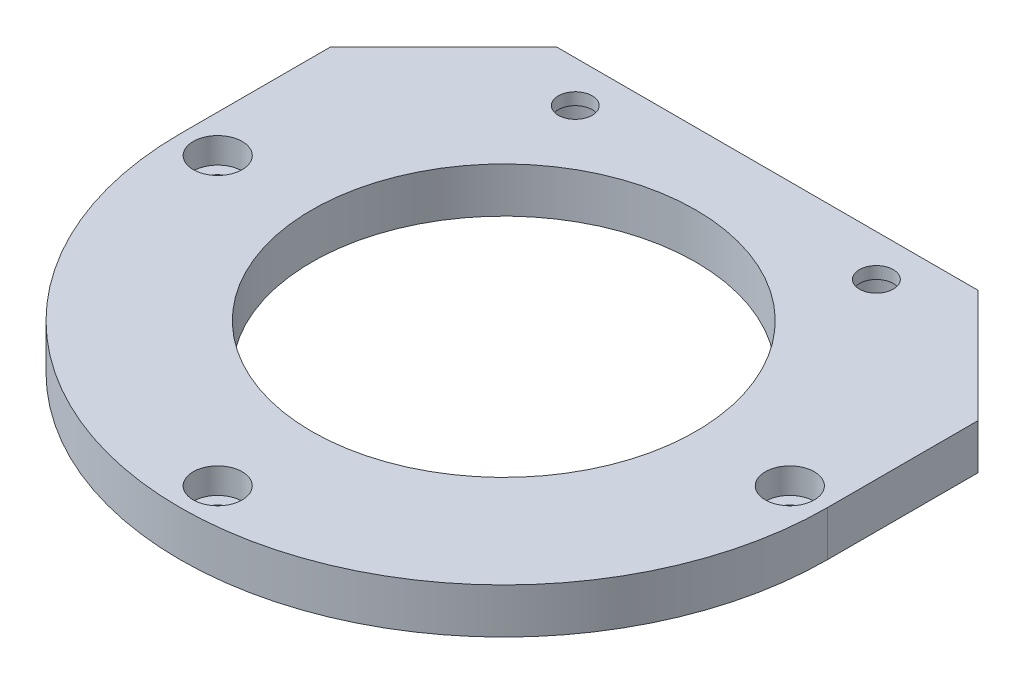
ISO-10303-21;
HEADER;
FILE_DESCRIPTION(('STEP AP214'),'2;1');
FILE_NAME('part.step','',(''),(''),'','','');
FILE_SCHEMA(('AUTOMOTIVE_DESIGN { 1 0 10303 214 1 1 1 1 }'));
ENDSEC;
DATA;
#1=APPLICATION_CONTEXT('core data for automotive mechanical design processes');
#2=APPLICATION_PROTOCOL_DEFINITION('international standard','automotive_design',2000,#1);
#3=PRODUCT_CONTEXT('',#1,'mechanical');
#4=PRODUCT('Part','Part','',(#3));
#5=PRODUCT_RELATED_PRODUCT_CATEGORY('part','',(#4));
#6=PRODUCT_DEFINITION_FORMATION('','',#4);
#7=PRODUCT_DEFINITION_CONTEXT('part definition',#1,'design');
#8=PRODUCT_DEFINITION('design','',#6,#7);
#9=PRODUCT_DEFINITION_SHAPE('','',#8);
#10=(LENGTH_UNIT() NAMED_UNIT(*) SI_UNIT(.MILLI.,.METRE.));
#11=(NAMED_UNIT(*) PLANE_ANGLE_UNIT() SI_UNIT($,.RADIAN.));
#12=(NAMED_UNIT(*) SI_UNIT($,.STERADIAN.) SOLID_ANGLE_UNIT());
#13=UNCERTAINTY_MEASURE_WITH_UNIT(LENGTH_MEASURE(1.E-05),#10,'distance_accuracy_value','');
#14=(GEOMETRIC_REPRESENTATION_CONTEXT(3) GLOBAL_UNCERTAINTY_ASSIGNED_CONTEXT((#13)) GLOBAL_UNIT_ASSIGNED_CONTEXT((#10,
#11,#12)) REPRESENTATION_CONTEXT('',''));
#15=CARTESIAN_POINT('',(0.,0.,0.));
#16=DIRECTION('',(0.,0.,1.));
#17=DIRECTION('',(1.,0.,0.));
#18=AXIS2_PLACEMENT_3D('',#15,#16,#17);
#19=CARTESIAN_POINT('',(0.,6.,0.));
#20=DIRECTION('',(0.,-1.,0.));
#21=DIRECTION('',(0.,0.,-1.));
#22=AXIS2_PLACEMENT_3D('',#19,#20,#21);
#23=CYLINDRICAL_SURFACE('',#22,43.);
#24=DIRECTION('',(0.,-1.,0.));
#25=VECTOR('',#24,1.);
#26=CARTESIAN_POINT('',(43.,6.,0.));
#27=LINE('',#26,#25);
#28=CARTESIAN_POINT('',(43.,6.,0.));
#29=VERTEX_POINT('',#28);
#30=CARTESIAN_POINT('',(43.,0.,0.));
#31=VERTEX_POINT('',#30);
#32=EDGE_CURVE('E126',#29,#31,#27,.T.);
#33=ORIENTED_EDGE('',*,*,#32,.F.);
#34=CARTESIAN_POINT('',(0.,6.,0.));
#35=DIRECTION('',(0.,1.,0.));
#36=DIRECTION('',(0.,0.,1.));
#37=AXIS2_PLACEMENT_3D('',#34,#35,#36);
#38=CIRCLE('',#37,43.);
#39=CARTESIAN_POINT('',(-43.,6.,0.));
#40=VERTEX_POINT('',#39);
#41=EDGE_CURVE('E42',#40,#29,#38,.T.);
#42=ORIENTED_EDGE('',*,*,#41,.F.);
#43=DIRECTION('',(0.,-1.,0.));
#44=VECTOR('',#43,1.);
#45=CARTESIAN_POINT('',(-43.,6.,0.));
#46=LINE('',#45,#44);
#47=CARTESIAN_POINT('',(-43.,0.,0.));
#48=VERTEX_POINT('',#47);
#49=EDGE_CURVE('E129',#48,#40,#46,.F.);
#50=ORIENTED_EDGE('',*,*,#49,.F.);
#51=CARTESIAN_POINT('',(0.,0.,0.));
#52=DIRECTION('',(0.,1.,0.));
#53=DIRECTION('',(0.,0.,1.));
#54=AXIS2_PLACEMENT_3D('',#51,#52,#53);
#55=CIRCLE('',#54,43.);
#56=EDGE_CURVE('E11',#31,#48,#55,.F.);
#57=ORIENTED_EDGE('',*,*,#56,.F.);
#58=EDGE_LOOP('',(#33,#42,#50,#57));
#59=FACE_BOUND('',#58,.T.);
#60=ADVANCED_FACE('F35',(#59),#23,.T.);
#61=CARTESIAN_POINT('',(43.,6.,-35.));
#62=DIRECTION('',(-1.,0.,0.));
#63=DIRECTION('',(0.,0.,1.));
#64=AXIS2_PLACEMENT_3D('',#61,#62,#63);
#65=PLANE('',#64);
#66=DIRECTION('',(0.,0.,-1.));
#67=VECTOR('',#66,1.);
#68=CARTESIAN_POINT('',(43.,6.,-35.));
#69=LINE('',#68,#67);
#70=CARTESIAN_POINT('',(43.,6.,-19.9999999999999));
#71=VERTEX_POINT('',#70);
#72=EDGE_CURVE('E105',#29,#71,#69,.T.);
#73=ORIENTED_EDGE('',*,*,#72,.F.);
#74=ORIENTED_EDGE('',*,*,#32,.T.);
#75=DIRECTION('',(0.,0.,-1.));
#76=VECTOR('',#75,1.);
#77=CARTESIAN_POINT('',(43.,0.,-35.));
#78=LINE('',#77,#76);
#79=CARTESIAN_POINT('',(43.,0.,-19.9999999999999));
#80=VERTEX_POINT('',#79);
#81=EDGE_CURVE('E110',#31,#80,#78,.T.);
#82=ORIENTED_EDGE('',*,*,#81,.T.);
#83=DIRECTION('',(0.,1.,0.));
#84=VECTOR('',#83,1.);
#85=CARTESIAN_POINT('',(43.,6.,-19.9999999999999));
#86=LINE('',#85,#84);
#87=EDGE_CURVE('E123',#80,#71,#86,.T.);
#88=ORIENTED_EDGE('',*,*,#87,.T.);
#89=EDGE_LOOP('',(#73,#74,#82,#88));
#90=FACE_BOUND('',#89,.T.);
#91=ADVANCED_FACE('F134',(#90),#65,.F.);
#92=CARTESIAN_POINT('',(-43.,6.,-35.));
#93=DIRECTION('',(0.,0.,1.));
#94=DIRECTION('',(1.,0.,0.));
#95=AXIS2_PLACEMENT_3D('',#92,#93,#94);
#96=PLANE('',#95);
#97=DIRECTION('',(-1.,0.,0.));
#98=VECTOR('',#97,1.);
#99=CARTESIAN_POINT('',(-43.,0.,-35.));
#100=LINE('',#99,#98);
#101=CARTESIAN_POINT('',(28.,0.,-35.));
#102=VERTEX_POINT('',#101);
#103=CARTESIAN_POINT('',(-28.,0.,-35.));
#104=VERTEX_POINT('',#103);
#105=EDGE_CURVE('E106',#102,#104,#100,.T.);
#106=ORIENTED_EDGE('',*,*,#105,.T.);
#107=DIRECTION('',(0.,1.,0.));
#108=VECTOR('',#107,1.);
#109=CARTESIAN_POINT('',(-28.,6.,-35.));
#110=LINE('',#109,#108);
#111=CARTESIAN_POINT('',(-28.,6.,-35.));
#112=VERTEX_POINT('',#111);
#113=EDGE_CURVE('E90',#104,#112,#110,.T.);
#114=ORIENTED_EDGE('',*,*,#113,.T.);
#115=DIRECTION('',(-1.,0.,0.));
#116=VECTOR('',#115,1.);
#117=CARTESIAN_POINT('',(-43.,6.,-35.));
#118=LINE('',#117,#116);
#119=CARTESIAN_POINT('',(28.,6.,-35.));
#120=VERTEX_POINT('',#119);
#121=EDGE_CURVE('E108',#120,#112,#118,.T.);
#122=ORIENTED_EDGE('',*,*,#121,.F.);
#123=DIRECTION('',(0.,-1.,0.));
#124=VECTOR('',#123,1.);
#125=CARTESIAN_POINT('',(28.,6.,-35.));
#126=LINE('',#125,#124);
#127=EDGE_CURVE('E93',#120,#102,#126,.T.);
#128=ORIENTED_EDGE('',*,*,#127,.T.);
#129=EDGE_LOOP('',(#106,#114,#122,#128));
#130=FACE_BOUND('',#129,.T.);
#131=ADVANCED_FACE('F143',(#130),#96,.F.);
#132=CARTESIAN_POINT('',(-43.,6.,-35.));
#133=DIRECTION('',(1.,0.,0.));
#134=DIRECTION('',(0.,0.,-1.));
#135=AXIS2_PLACEMENT_3D('',#132,#133,#134);
#136=PLANE('',#135);
#137=DIRECTION('',(0.,0.,1.));
#138=VECTOR('',#137,1.);
#139=CARTESIAN_POINT('',(-43.,0.,-35.));
#140=LINE('',#139,#138);
#141=CARTESIAN_POINT('',(-43.,0.,-20.));
#142=VERTEX_POINT('',#141);
#143=EDGE_CURVE('E100',#142,#48,#140,.T.);
#144=ORIENTED_EDGE('',*,*,#143,.T.);
#145=ORIENTED_EDGE('',*,*,#49,.T.);
#146=DIRECTION('',(0.,0.,1.));
#147=VECTOR('',#146,1.);
#148=CARTESIAN_POINT('',(-43.,6.,-35.));
#149=LINE('',#148,#147);
#150=CARTESIAN_POINT('',(-43.,6.,-20.));
#151=VERTEX_POINT('',#150);
#152=EDGE_CURVE('E102',#151,#40,#149,.T.);
#153=ORIENTED_EDGE('',*,*,#152,.F.);
#154=DIRECTION('',(0.,-1.,0.));
#155=VECTOR('',#154,1.);
#156=CARTESIAN_POINT('',(-43.,6.,-20.));
#157=LINE('',#156,#155);
#158=EDGE_CURVE('E89',#151,#142,#157,.T.);
#159=ORIENTED_EDGE('',*,*,#158,.T.);
#160=EDGE_LOOP('',(#144,#145,#153,#159));
#161=FACE_BOUND('',#160,.T.);
#162=ADVANCED_FACE('F99',(#161),#136,.F.);
#163=CARTESIAN_POINT('',(0.,6.,0.));
#164=DIRECTION('',(0.,1.,0.));
#165=DIRECTION('',(0.,0.,1.));
#166=AXIS2_PLACEMENT_3D('',#163,#164,#165);
#167=PLANE('',#166);
#168=CARTESIAN_POINT('',(20.,6.,-29.5));
#169=DIRECTION('',(0.,1.,0.));
#170=DIRECTION('',(0.,0.,1.));
#171=AXIS2_PLACEMENT_3D('',#168,#169,#170);
#172=CIRCLE('',#171,2.25);
#173=CARTESIAN_POINT('',(20.,6.,-27.25));
#174=VERTEX_POINT('',#173);
#175=EDGE_CURVE('E203',#174,#174,#172,.T.);
#176=ORIENTED_EDGE('',*,*,#175,.F.);
#177=EDGE_LOOP('',(#176));
#178=FACE_BOUND('',#177,.T.);
#179=CARTESIAN_POINT('',(-20.,6.,-29.5));
#180=DIRECTION('',(0.,1.,0.));
#181=DIRECTION('',(0.,0.,1.));
#182=AXIS2_PLACEMENT_3D('',#179,#180,#181);
#183=CIRCLE('',#182,2.25);
#184=CARTESIAN_POINT('',(-20.,6.,-27.25));
#185=VERTEX_POINT('',#184);
#186=EDGE_CURVE('E191',#185,#185,#183,.T.);
#187=ORIENTED_EDGE('',*,*,#186,.F.);
#188=EDGE_LOOP('',(#187));
#189=FACE_BOUND('',#188,.T.);
#190=CARTESIAN_POINT('',(-38.,6.,0.));
#191=DIRECTION('',(0.,1.,0.));
#192=DIRECTION('',(0.,0.,1.));
#193=AXIS2_PLACEMENT_3D('',#190,#191,#192);
#194=CIRCLE('',#193,3.25);
#195=CARTESIAN_POINT('',(-38.,6.,3.25));
#196=VERTEX_POINT('',#195);
#197=EDGE_CURVE('E188',#196,#196,#194,.T.);
#198=ORIENTED_EDGE('',*,*,#197,.F.);
#199=EDGE_LOOP('',(#198));
#200=FACE_BOUND('',#199,.T.);
#201=CARTESIAN_POINT('',(0.,6.,38.));
#202=DIRECTION('',(0.,1.,0.));
#203=DIRECTION('',(0.,0.,1.));
#204=AXIS2_PLACEMENT_3D('',#201,#202,#203);
#205=CIRCLE('',#204,3.25);
#206=CARTESIAN_POINT('',(0.,6.,41.25));
#207=VERTEX_POINT('',#206);
#208=EDGE_CURVE('E176',#207,#207,#205,.T.);
#209=ORIENTED_EDGE('',*,*,#208,.F.);
#210=EDGE_LOOP('',(#209));
#211=FACE_BOUND('',#210,.T.);
#212=CARTESIAN_POINT('',(38.,6.,0.));
#213=DIRECTION('',(0.,1.,0.));
#214=DIRECTION('',(0.,0.,1.));
#215=AXIS2_PLACEMENT_3D('',#212,#213,#214);
#216=CIRCLE('',#215,3.25);
#217=CARTESIAN_POINT('',(38.,6.,3.25));
#218=VERTEX_POINT('',#217);
#219=EDGE_CURVE('E164',#218,#218,#216,.T.);
#220=ORIENTED_EDGE('',*,*,#219,.F.);
#221=EDGE_LOOP('',(#220));
#222=FACE_BOUND('',#221,.T.);
#223=CARTESIAN_POINT('',(0.,6.,0.));
#224=DIRECTION('',(0.,1.,0.));
#225=DIRECTION('',(0.,0.,1.));
#226=AXIS2_PLACEMENT_3D('',#223,#224,#225);
#227=CIRCLE('',#226,25.5);
#228=CARTESIAN_POINT('',(0.,6.,25.5));
#229=VERTEX_POINT('',#228);
#230=EDGE_CURVE('E149',#229,#229,#227,.T.);
#231=ORIENTED_EDGE('',*,*,#230,.F.);
#232=EDGE_LOOP('',(#231));
#233=FACE_BOUND('',#232,.T.);
#234=ORIENTED_EDGE('',*,*,#152,.T.);
#235=ORIENTED_EDGE('',*,*,#41,.T.);
#236=ORIENTED_EDGE('',*,*,#72,.T.);
#237=DIRECTION('',(0.707106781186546,0.,0.707106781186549));
#238=VECTOR('',#237,1.);
#239=CARTESIAN_POINT('',(31.5,6.,-31.4999999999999));
#240=LINE('',#239,#238);
#241=EDGE_CURVE('E119',#71,#120,#240,.F.);
#242=ORIENTED_EDGE('',*,*,#241,.T.);
#243=ORIENTED_EDGE('',*,*,#121,.T.);
#244=DIRECTION('',(0.707106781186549,0.,-0.707106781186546));
#245=VECTOR('',#244,1.);
#246=CARTESIAN_POINT('',(-31.4999999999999,6.,-31.5));
#247=LINE('',#246,#245);
#248=EDGE_CURVE('E121',#112,#151,#247,.F.);
#249=ORIENTED_EDGE('',*,*,#248,.T.);
#250=EDGE_LOOP('',(#234,#235,#236,#242,#243,#249));
#251=FACE_BOUND('',#250,.T.);
#252=ADVANCED_FACE('F131',(#178,#189,#200,#211,#222,#233,#251),#167,.T.);
#253=CARTESIAN_POINT('',(0.,0.,0.));
#254=DIRECTION('',(0.,1.,0.));
#255=DIRECTION('',(0.,0.,1.));
#256=AXIS2_PLACEMENT_3D('',#253,#254,#255);
#257=PLANE('',#256);
#258=CARTESIAN_POINT('',(20.,0.,-29.5));
#259=DIRECTION('',(0.,-1.,0.));
#260=DIRECTION('',(0.,0.,-1.));
#261=AXIS2_PLACEMENT_3D('',#258,#259,#260);
#262=CIRCLE('',#261,4.);
#263=CARTESIAN_POINT('',(20.,0.,-33.5));
#264=VERTEX_POINT('',#263);
#265=EDGE_CURVE('E212',#264,#264,#262,.T.);
#266=ORIENTED_EDGE('',*,*,#265,.F.);
#267=EDGE_LOOP('',(#266));
#268=FACE_BOUND('',#267,.T.);
#269=CARTESIAN_POINT('',(-20.,0.,-29.5));
#270=DIRECTION('',(0.,-1.,0.));
#271=DIRECTION('',(0.,0.,-1.));
#272=AXIS2_PLACEMENT_3D('',#269,#270,#271);
#273=CIRCLE('',#272,4.);
#274=CARTESIAN_POINT('',(-20.,0.,-33.5));
#275=VERTEX_POINT('',#274);
#276=EDGE_CURVE('E200',#275,#275,#273,.T.);
#277=ORIENTED_EDGE('',*,*,#276,.F.);
#278=EDGE_LOOP('',(#277));
#279=FACE_BOUND('',#278,.T.);
#280=CARTESIAN_POINT('',(-38.,0.,0.));
#281=DIRECTION('',(0.,1.,0.));
#282=DIRECTION('',(0.,0.,1.));
#283=AXIS2_PLACEMENT_3D('',#280,#281,#282);
#284=CIRCLE('',#283,1.7);
#285=CARTESIAN_POINT('',(-38.,0.,1.7));
#286=VERTEX_POINT('',#285);
#287=EDGE_CURVE('E179',#286,#286,#284,.T.);
#288=ORIENTED_EDGE('',*,*,#287,.T.);
#289=EDGE_LOOP('',(#288));
#290=FACE_BOUND('',#289,.T.);
#291=CARTESIAN_POINT('',(0.,0.,38.));
#292=DIRECTION('',(0.,1.,0.));
#293=DIRECTION('',(0.,0.,1.));
#294=AXIS2_PLACEMENT_3D('',#291,#292,#293);
#295=CIRCLE('',#294,1.7);
#296=CARTESIAN_POINT('',(0.,0.,39.7));
#297=VERTEX_POINT('',#296);
#298=EDGE_CURVE('E167',#297,#297,#295,.T.);
#299=ORIENTED_EDGE('',*,*,#298,.T.);
#300=EDGE_LOOP('',(#299));
#301=FACE_BOUND('',#300,.T.);
#302=CARTESIAN_POINT('',(38.,0.,0.));
#303=DIRECTION('',(0.,1.,0.));
#304=DIRECTION('',(0.,0.,1.));
#305=AXIS2_PLACEMENT_3D('',#302,#303,#304);
#306=CIRCLE('',#305,1.7);
#307=CARTESIAN_POINT('',(38.,0.,1.7));
#308=VERTEX_POINT('',#307);
#309=EDGE_CURVE('E153',#308,#308,#306,.T.);
#310=ORIENTED_EDGE('',*,*,#309,.T.);
#311=EDGE_LOOP('',(#310));
#312=FACE_BOUND('',#311,.T.);
#313=CARTESIAN_POINT('',(0.,0.,0.));
#314=DIRECTION('',(0.,1.,0.));
#315=DIRECTION('',(0.,0.,1.));
#316=AXIS2_PLACEMENT_3D('',#313,#314,#315);
#317=CIRCLE('',#316,25.5);
#318=CARTESIAN_POINT('',(0.,0.,25.5));
#319=VERTEX_POINT('',#318);
#320=EDGE_CURVE('E147',#319,#319,#317,.T.);
#321=ORIENTED_EDGE('',*,*,#320,.T.);
#322=EDGE_LOOP('',(#321));
#323=FACE_BOUND('',#322,.T.);
#324=ORIENTED_EDGE('',*,*,#81,.F.);
#325=ORIENTED_EDGE('',*,*,#56,.T.);
#326=ORIENTED_EDGE('',*,*,#143,.F.);
#327=DIRECTION('',(-0.707106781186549,0.,0.707106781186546));
#328=VECTOR('',#327,1.);
#329=CARTESIAN_POINT('',(-43.,0.,-20.));
#330=LINE('',#329,#328);
#331=EDGE_CURVE('E85',#142,#104,#330,.F.);
#332=ORIENTED_EDGE('',*,*,#331,.T.);
#333=ORIENTED_EDGE('',*,*,#105,.F.);
#334=DIRECTION('',(-0.707106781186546,0.,-0.707106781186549));
#335=VECTOR('',#334,1.);
#336=CARTESIAN_POINT('',(28.,0.,-35.));
#337=LINE('',#336,#335);
#338=EDGE_CURVE('E94',#102,#80,#337,.F.);
#339=ORIENTED_EDGE('',*,*,#338,.T.);
#340=EDGE_LOOP('',(#324,#325,#326,#332,#333,#339));
#341=FACE_BOUND('',#340,.T.);
#342=ADVANCED_FACE('F104',(#268,#279,#290,#301,#312,#323,#341),#257,.F.);
#343=CARTESIAN_POINT('',(0.,6.,0.));
#344=DIRECTION('',(0.,1.,0.));
#345=DIRECTION('',(0.,0.,1.));
#346=AXIS2_PLACEMENT_3D('',#343,#344,#345);
#347=CYLINDRICAL_SURFACE('',#346,25.5);
#348=ORIENTED_EDGE('',*,*,#320,.F.);
#349=EDGE_LOOP('',(#348));
#350=FACE_BOUND('',#349,.T.);
#351=ORIENTED_EDGE('',*,*,#230,.T.);
#352=EDGE_LOOP('',(#351));
#353=FACE_BOUND('',#352,.T.);
#354=ADVANCED_FACE('F220',(#350,#353),#347,.F.);
#355=CARTESIAN_POINT('',(38.,6.,0.));
#356=DIRECTION('',(0.,1.,0.));
#357=DIRECTION('',(0.,0.,1.));
#358=AXIS2_PLACEMENT_3D('',#355,#356,#357);
#359=CYLINDRICAL_SURFACE('',#358,1.7);
#360=ORIENTED_EDGE('',*,*,#309,.F.);
#361=EDGE_LOOP('',(#360));
#362=FACE_BOUND('',#361,.T.);
#363=CARTESIAN_POINT('',(38.,2.6,0.));
#364=DIRECTION('',(0.,1.,0.));
#365=DIRECTION('',(0.,0.,1.));
#366=AXIS2_PLACEMENT_3D('',#363,#364,#365);
#367=CIRCLE('',#366,1.7);
#368=CARTESIAN_POINT('',(38.,2.6,1.7));
#369=VERTEX_POINT('',#368);
#370=EDGE_CURVE('E158',#369,#369,#367,.T.);
#371=ORIENTED_EDGE('',*,*,#370,.T.);
#372=EDGE_LOOP('',(#371));
#373=FACE_BOUND('',#372,.T.);
#374=ADVANCED_FACE('F230',(#362,#373),#359,.F.);
#375=CARTESIAN_POINT('',(39.7,2.6,0.));
#376=DIRECTION('',(0.,-1.,0.));
#377=DIRECTION('',(0.,0.,-1.));
#378=AXIS2_PLACEMENT_3D('',#375,#376,#377);
#379=PLANE('',#378);
#380=ORIENTED_EDGE('',*,*,#370,.F.);
#381=EDGE_LOOP('',(#380));
#382=FACE_BOUND('',#381,.T.);
#383=CARTESIAN_POINT('',(38.,2.6,0.));
#384=DIRECTION('',(0.,1.,0.));
#385=DIRECTION('',(0.,0.,1.));
#386=AXIS2_PLACEMENT_3D('',#383,#384,#385);
#387=CIRCLE('',#386,3.25);
#388=CARTESIAN_POINT('',(38.,2.6,3.25));
#389=VERTEX_POINT('',#388);
#390=EDGE_CURVE('E161',#389,#389,#387,.T.);
#391=ORIENTED_EDGE('',*,*,#390,.T.);
#392=EDGE_LOOP('',(#391));
#393=FACE_BOUND('',#392,.T.);
#394=ADVANCED_FACE('F233',(#382,#393),#379,.F.);
#395=CARTESIAN_POINT('',(38.,6.,0.));
#396=DIRECTION('',(0.,1.,0.));
#397=DIRECTION('',(0.,0.,1.));
#398=AXIS2_PLACEMENT_3D('',#395,#396,#397);
#399=CYLINDRICAL_SURFACE('',#398,3.25);
#400=ORIENTED_EDGE('',*,*,#390,.F.);
#401=EDGE_LOOP('',(#400));
#402=FACE_BOUND('',#401,.T.);
#403=ORIENTED_EDGE('',*,*,#219,.T.);
#404=EDGE_LOOP('',(#403));
#405=FACE_BOUND('',#404,.T.);
#406=ADVANCED_FACE('F239',(#402,#405),#399,.F.);
#407=CARTESIAN_POINT('',(0.,6.,38.));
#408=DIRECTION('',(0.,1.,0.));
#409=DIRECTION('',(0.,0.,1.));
#410=AXIS2_PLACEMENT_3D('',#407,#408,#409);
#411=CYLINDRICAL_SURFACE('',#410,1.7);
#412=ORIENTED_EDGE('',*,*,#298,.F.);
#413=EDGE_LOOP('',(#412));
#414=FACE_BOUND('',#413,.T.);
#415=CARTESIAN_POINT('',(0.,2.6,38.));
#416=DIRECTION('',(0.,1.,0.));
#417=DIRECTION('',(0.,0.,1.));
#418=AXIS2_PLACEMENT_3D('',#415,#416,#417);
#419=CIRCLE('',#418,1.7);
#420=CARTESIAN_POINT('',(0.,2.6,39.7));
#421=VERTEX_POINT('',#420);
#422=EDGE_CURVE('E170',#421,#421,#419,.T.);
#423=ORIENTED_EDGE('',*,*,#422,.T.);
#424=EDGE_LOOP('',(#423));
#425=FACE_BOUND('',#424,.T.);
#426=ADVANCED_FACE('F245',(#414,#425),#411,.F.);
#427=CARTESIAN_POINT('',(1.7,2.6,38.));
#428=DIRECTION('',(0.,-1.,0.));
#429=DIRECTION('',(0.,0.,-1.));
#430=AXIS2_PLACEMENT_3D('',#427,#428,#429);
#431=PLANE('',#430);
#432=ORIENTED_EDGE('',*,*,#422,.F.);
#433=EDGE_LOOP('',(#432));
#434=FACE_BOUND('',#433,.T.);
#435=CARTESIAN_POINT('',(0.,2.6,38.));
#436=DIRECTION('',(0.,1.,0.));
#437=DIRECTION('',(0.,0.,1.));
#438=AXIS2_PLACEMENT_3D('',#435,#436,#437);
#439=CIRCLE('',#438,3.25);
#440=CARTESIAN_POINT('',(0.,2.6,41.25));
#441=VERTEX_POINT('',#440);
#442=EDGE_CURVE('E173',#441,#441,#439,.T.);
#443=ORIENTED_EDGE('',*,*,#442,.T.);
#444=EDGE_LOOP('',(#443));
#445=FACE_BOUND('',#444,.T.);
#446=ADVANCED_FACE('F358',(#434,#445),#431,.F.);
#447=CARTESIAN_POINT('',(0.,6.,38.));
#448=DIRECTION('',(0.,1.,0.));
#449=DIRECTION('',(0.,0.,1.));
#450=AXIS2_PLACEMENT_3D('',#447,#448,#449);
#451=CYLINDRICAL_SURFACE('',#450,3.25);
#452=ORIENTED_EDGE('',*,*,#442,.F.);
#453=EDGE_LOOP('',(#452));
#454=FACE_BOUND('',#453,.T.);
#455=ORIENTED_EDGE('',*,*,#208,.T.);
#456=EDGE_LOOP('',(#455));
#457=FACE_BOUND('',#456,.T.);
#458=ADVANCED_FACE('F350',(#454,#457),#451,.F.);
#459=CARTESIAN_POINT('',(-38.,6.,0.));
#460=DIRECTION('',(0.,1.,0.));
#461=DIRECTION('',(0.,0.,1.));
#462=AXIS2_PLACEMENT_3D('',#459,#460,#461);
#463=CYLINDRICAL_SURFACE('',#462,1.7);
#464=ORIENTED_EDGE('',*,*,#287,.F.);
#465=EDGE_LOOP('',(#464));
#466=FACE_BOUND('',#465,.T.);
#467=CARTESIAN_POINT('',(-38.,2.6,0.));
#468=DIRECTION('',(0.,1.,0.));
#469=DIRECTION('',(0.,0.,1.));
#470=AXIS2_PLACEMENT_3D('',#467,#468,#469);
#471=CIRCLE('',#470,1.7);
#472=CARTESIAN_POINT('',(-38.,2.6,1.7));
#473=VERTEX_POINT('',#472);
#474=EDGE_CURVE('E182',#473,#473,#471,.T.);
#475=ORIENTED_EDGE('',*,*,#474,.T.);
#476=EDGE_LOOP('',(#475));
#477=FACE_BOUND('',#476,.T.);
#478=ADVANCED_FACE('F342',(#466,#477),#463,.F.);
#479=CARTESIAN_POINT('',(-36.3,2.6,0.));
#480=DIRECTION('',(0.,-1.,0.));
#481=DIRECTION('',(0.,0.,-1.));
#482=AXIS2_PLACEMENT_3D('',#479,#480,#481);
#483=PLANE('',#482);
#484=ORIENTED_EDGE('',*,*,#474,.F.);
#485=EDGE_LOOP('',(#484));
#486=FACE_BOUND('',#485,.T.);
#487=CARTESIAN_POINT('',(-38.,2.6,0.));
#488=DIRECTION('',(0.,1.,0.));
#489=DIRECTION('',(0.,0.,1.));
#490=AXIS2_PLACEMENT_3D('',#487,#488,#489);
#491=CIRCLE('',#490,3.25);
#492=CARTESIAN_POINT('',(-38.,2.6,3.25));
#493=VERTEX_POINT('',#492);
#494=EDGE_CURVE('E185',#493,#493,#491,.T.);
#495=ORIENTED_EDGE('',*,*,#494,.T.);
#496=EDGE_LOOP('',(#495));
#497=FACE_BOUND('',#496,.T.);
#498=ADVANCED_FACE('F334',(#486,#497),#483,.F.);
#499=CARTESIAN_POINT('',(-38.,6.,0.));
#500=DIRECTION('',(0.,1.,0.));
#501=DIRECTION('',(0.,0.,1.));
#502=AXIS2_PLACEMENT_3D('',#499,#500,#501);
#503=CYLINDRICAL_SURFACE('',#502,3.25);
#504=ORIENTED_EDGE('',*,*,#494,.F.);
#505=EDGE_LOOP('',(#504));
#506=FACE_BOUND('',#505,.T.);
#507=ORIENTED_EDGE('',*,*,#197,.T.);
#508=EDGE_LOOP('',(#507));
#509=FACE_BOUND('',#508,.T.);
#510=ADVANCED_FACE('F326',(#506,#509),#503,.F.);
#511=CARTESIAN_POINT('',(-20.,0.,-29.5));
#512=DIRECTION('',(0.,-1.,0.));
#513=DIRECTION('',(0.,0.,-1.));
#514=AXIS2_PLACEMENT_3D('',#511,#512,#513);
#515=CYLINDRICAL_SURFACE('',#514,2.25);
#516=CARTESIAN_POINT('',(-20.,4.4,-29.5));
#517=DIRECTION('',(0.,-1.,0.));
#518=DIRECTION('',(0.,0.,-1.));
#519=AXIS2_PLACEMENT_3D('',#516,#517,#518);
#520=CIRCLE('',#519,2.25);
#521=CARTESIAN_POINT('',(-20.,4.4,-31.75));
#522=VERTEX_POINT('',#521);
#523=EDGE_CURVE('E194',#522,#522,#520,.T.);
#524=ORIENTED_EDGE('',*,*,#523,.T.);
#525=EDGE_LOOP('',(#524));
#526=FACE_BOUND('',#525,.T.);
#527=ORIENTED_EDGE('',*,*,#186,.T.);
#528=EDGE_LOOP('',(#527));
#529=FACE_BOUND('',#528,.T.);
#530=ADVANCED_FACE('F318',(#526,#529),#515,.F.);
#531=CARTESIAN_POINT('',(-17.75,4.4,-29.5));
#532=DIRECTION('',(0.,1.,0.));
#533=DIRECTION('',(0.,0.,1.));
#534=AXIS2_PLACEMENT_3D('',#531,#532,#533);
#535=PLANE('',#534);
#536=ORIENTED_EDGE('',*,*,#523,.F.);
#537=EDGE_LOOP('',(#536));
#538=FACE_BOUND('',#537,.T.);
#539=CARTESIAN_POINT('',(-20.,4.4,-29.5));
#540=DIRECTION('',(0.,-1.,0.));
#541=DIRECTION('',(0.,0.,-1.));
#542=AXIS2_PLACEMENT_3D('',#539,#540,#541);
#543=CIRCLE('',#542,4.);
#544=CARTESIAN_POINT('',(-20.,4.4,-33.5));
#545=VERTEX_POINT('',#544);
#546=EDGE_CURVE('E197',#545,#545,#543,.T.);
#547=ORIENTED_EDGE('',*,*,#546,.T.);
#548=EDGE_LOOP('',(#547));
#549=FACE_BOUND('',#548,.T.);
#550=ADVANCED_FACE('F310',(#538,#549),#535,.F.);
#551=CARTESIAN_POINT('',(-20.,0.,-29.5));
#552=DIRECTION('',(0.,-1.,0.));
#553=DIRECTION('',(0.,0.,-1.));
#554=AXIS2_PLACEMENT_3D('',#551,#552,#553);
#555=CYLINDRICAL_SURFACE('',#554,4.);
#556=ORIENTED_EDGE('',*,*,#546,.F.);
#557=EDGE_LOOP('',(#556));
#558=FACE_BOUND('',#557,.T.);
#559=ORIENTED_EDGE('',*,*,#276,.T.);
#560=EDGE_LOOP('',(#559));
#561=FACE_BOUND('',#560,.T.);
#562=ADVANCED_FACE('F302',(#558,#561),#555,.F.);
#563=CARTESIAN_POINT('',(20.,0.,-29.5));
#564=DIRECTION('',(0.,-1.,0.));
#565=DIRECTION('',(0.,0.,-1.));
#566=AXIS2_PLACEMENT_3D('',#563,#564,#565);
#567=CYLINDRICAL_SURFACE('',#566,2.25);
#568=CARTESIAN_POINT('',(20.,4.4,-29.5));
#569=DIRECTION('',(0.,-1.,0.));
#570=DIRECTION('',(0.,0.,-1.));
#571=AXIS2_PLACEMENT_3D('',#568,#569,#570);
#572=CIRCLE('',#571,2.25);
#573=CARTESIAN_POINT('',(20.,4.4,-31.75));
#574=VERTEX_POINT('',#573);
#575=EDGE_CURVE('E206',#574,#574,#572,.T.);
#576=ORIENTED_EDGE('',*,*,#575,.T.);
#577=EDGE_LOOP('',(#576));
#578=FACE_BOUND('',#577,.T.);
#579=ORIENTED_EDGE('',*,*,#175,.T.);
#580=EDGE_LOOP('',(#579));
#581=FACE_BOUND('',#580,.T.);
#582=ADVANCED_FACE('F294',(#578,#581),#567,.F.);
#583=CARTESIAN_POINT('',(22.25,4.4,-29.5));
#584=DIRECTION('',(0.,1.,0.));
#585=DIRECTION('',(0.,0.,1.));
#586=AXIS2_PLACEMENT_3D('',#583,#584,#585);
#587=PLANE('',#586);
#588=ORIENTED_EDGE('',*,*,#575,.F.);
#589=EDGE_LOOP('',(#588));
#590=FACE_BOUND('',#589,.T.);
#591=CARTESIAN_POINT('',(20.,4.4,-29.5));
#592=DIRECTION('',(0.,-1.,0.));
#593=DIRECTION('',(0.,0.,-1.));
#594=AXIS2_PLACEMENT_3D('',#591,#592,#593);
#595=CIRCLE('',#594,4.);
#596=CARTESIAN_POINT('',(20.,4.4,-33.5));
#597=VERTEX_POINT('',#596);
#598=EDGE_CURVE('E209',#597,#597,#595,.T.);
#599=ORIENTED_EDGE('',*,*,#598,.T.);
#600=EDGE_LOOP('',(#599));
#601=FACE_BOUND('',#600,.T.);
#602=ADVANCED_FACE('F286',(#590,#601),#587,.F.);
#603=CARTESIAN_POINT('',(20.,0.,-29.5));
#604=DIRECTION('',(0.,-1.,0.));
#605=DIRECTION('',(0.,0.,-1.));
#606=AXIS2_PLACEMENT_3D('',#603,#604,#605);
#607=CYLINDRICAL_SURFACE('',#606,4.);
#608=ORIENTED_EDGE('',*,*,#598,.F.);
#609=EDGE_LOOP('',(#608));
#610=FACE_BOUND('',#609,.T.);
#611=ORIENTED_EDGE('',*,*,#265,.T.);
#612=EDGE_LOOP('',(#611));
#613=FACE_BOUND('',#612,.T.);
#614=ADVANCED_FACE('F216',(#610,#613),#607,.F.);
#615=CARTESIAN_POINT('',(-43.,6.,-20.));
#616=DIRECTION('',(0.707106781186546,0.,0.707106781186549));
#617=DIRECTION('',(0.,-1.,0.));
#618=AXIS2_PLACEMENT_3D('',#615,#616,#617);
#619=PLANE('',#618);
#620=ORIENTED_EDGE('',*,*,#248,.F.);
#621=ORIENTED_EDGE('',*,*,#113,.F.);
#622=ORIENTED_EDGE('',*,*,#331,.F.);
#623=ORIENTED_EDGE('',*,*,#158,.F.);
#624=EDGE_LOOP('',(#620,#621,#622,#623));
#625=FACE_BOUND('',#624,.T.);
#626=ADVANCED_FACE('F88',(#625),#619,.F.);
#627=CARTESIAN_POINT('',(28.,6.,-35.));
#628=DIRECTION('',(-0.707106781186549,0.,0.707106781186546));
#629=DIRECTION('',(0.,-1.,0.));
#630=AXIS2_PLACEMENT_3D('',#627,#628,#629);
#631=PLANE('',#630);
#632=ORIENTED_EDGE('',*,*,#241,.F.);
#633=ORIENTED_EDGE('',*,*,#87,.F.);
#634=ORIENTED_EDGE('',*,*,#338,.F.);
#635=ORIENTED_EDGE('',*,*,#127,.F.);
#636=EDGE_LOOP('',(#632,#633,#634,#635));
#637=FACE_BOUND('',#636,.T.);
#638=ADVANCED_FACE('F139',(#637),#631,.F.);
#639=CLOSED_SHELL('',(#60,#91,#131,#162,#252,#342,#354,#374,#394,#406,#426,#446,#458,#478,#498,
#510,#530,#550,#562,#582,#602,#614,#626,#638));
#640=MANIFOLD_SOLID_BREP('B2',#639);
#641=ADVANCED_BREP_SHAPE_REPRESENTATION('',(#18,#640),#14);
#642=SHAPE_DEFINITION_REPRESENTATION(#9,#641);
ENDSEC;
END-ISO-10303-21;
